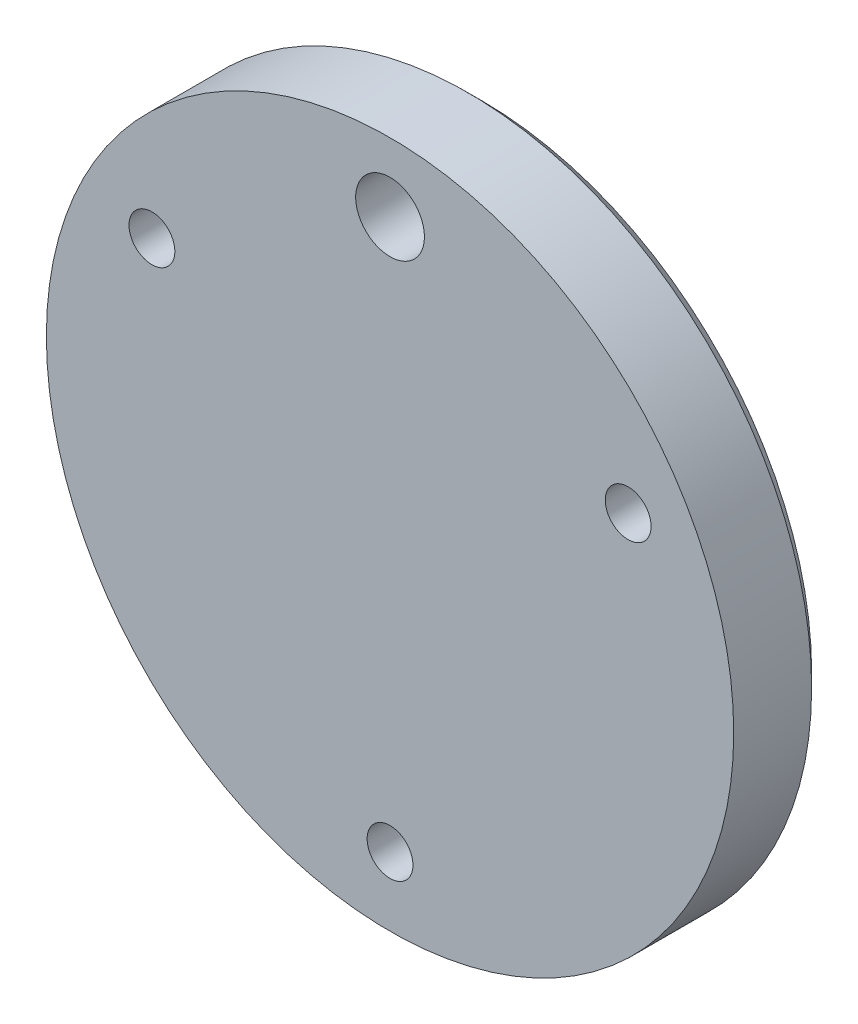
from build123d import *

# Parameters (mm, degrees)
SKIZZE1_R                       = 7.5
LINEAR_AUSTRAGEN1_DEPTH         = 2
SCHNITT_LINEAR_AUSTRAGEN1_REACH = 12.794
SKIZZE2_R                       = 0.75
SKIZZE3_R                       = 0.5
SCHNITT_LINEAR_AUSTRAGEN2_DEPTH = 2
FASE1_SIZE                      = 0.3
FASE2_SIZE                      = 0.1


with BuildPart() as part:
    # Skizze1 → Linear austragen1 (new body)
    with BuildSketch(Plane.XY):
        Circle(SKIZZE1_R)
    extrude(amount=LINEAR_AUSTRAGEN1_DEPTH)

    # Skizze2 → Schnitt-Linear austragen1 (cut, up to next)
    with BuildSketch(Plane(origin=(0, 0, 0), x_dir=(-1, 0, 0), z_dir=(0, 0, -1)), mode=Mode.PRIVATE) as schnitt_linear_austragen1_sk1:
        with Locations((0, 6)):
            Circle(SKIZZE2_R)
    schnitt_linear_austragen1_tool1 = extrude(schnitt_linear_austragen1_sk1.sketch, amount=-SCHNITT_LINEAR_AUSTRAGEN1_REACH, mode=Mode.PRIVATE) & part.part
    add(schnitt_linear_austragen1_tool1.solids().sort_by_distance((0, 6, 0))[0], mode=Mode.SUBTRACT)

    # Skizze3 → Schnitt-Linear austragen2 (cut)
    with BuildSketch(Plane(origin=(0, 0, 0), x_dir=(-1, 0, 0), z_dir=(0, 0, -1))):
        with Locations((0, -6)):
            Circle(SKIZZE3_R)
        with Locations((-5.196152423, 3)):
            Circle(SKIZZE3_R)
        with Locations((5.196152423, 3)):
            Circle(SKIZZE3_R)
    extrude(amount=-SCHNITT_LINEAR_AUSTRAGEN2_DEPTH, mode=Mode.SUBTRACT)

    # Fase1
    fase1_edges = [part.edges().sort_by_distance(p)[0] for p in [
        (-7.5, 0, 0),
    ]]
    chamfer(fase1_edges, length=FASE1_SIZE)

    # Fase2
    fase2_edges = [part.edges().sort_by_distance(p)[0] for p in [
        (0.5, -6, 0),
        (5.696152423, 3, 0),
        (-4.696152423, 3, 0),
        (0.75, 6, 0),
    ]]
    chamfer(fase2_edges, length=FASE2_SIZE)


solid = part.part
